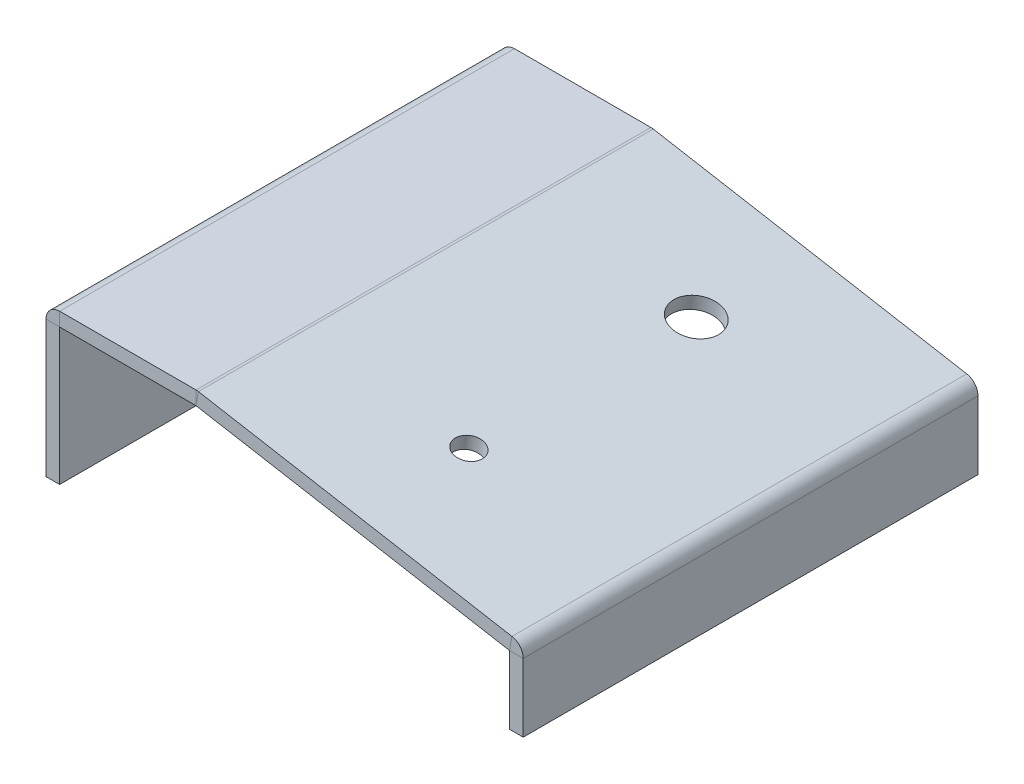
ISO-10303-21;
HEADER;
FILE_DESCRIPTION(('STEP AP214'),'2;1');
FILE_NAME('part.step','',(''),(''),'','','');
FILE_SCHEMA(('AUTOMOTIVE_DESIGN { 1 0 10303 214 1 1 1 1 }'));
ENDSEC;
DATA;
#1=APPLICATION_CONTEXT('core data for automotive mechanical design processes');
#2=APPLICATION_PROTOCOL_DEFINITION('international standard','automotive_design',2000,#1);
#3=PRODUCT_CONTEXT('',#1,'mechanical');
#4=PRODUCT('Part','Part','',(#3));
#5=PRODUCT_RELATED_PRODUCT_CATEGORY('part','',(#4));
#6=PRODUCT_DEFINITION_FORMATION('','',#4);
#7=PRODUCT_DEFINITION_CONTEXT('part definition',#1,'design');
#8=PRODUCT_DEFINITION('design','',#6,#7);
#9=PRODUCT_DEFINITION_SHAPE('','',#8);
#10=(LENGTH_UNIT() NAMED_UNIT(*) SI_UNIT(.MILLI.,.METRE.));
#11=(NAMED_UNIT(*) PLANE_ANGLE_UNIT() SI_UNIT($,.RADIAN.));
#12=(NAMED_UNIT(*) SI_UNIT($,.STERADIAN.) SOLID_ANGLE_UNIT());
#13=UNCERTAINTY_MEASURE_WITH_UNIT(LENGTH_MEASURE(1.E-05),#10,'distance_accuracy_value','');
#14=(GEOMETRIC_REPRESENTATION_CONTEXT(3) GLOBAL_UNCERTAINTY_ASSIGNED_CONTEXT((#13)) GLOBAL_UNIT_ASSIGNED_CONTEXT((#10,
#11,#12)) REPRESENTATION_CONTEXT('',''));
#15=CARTESIAN_POINT('',(0.,0.,0.));
#16=DIRECTION('',(0.,0.,1.));
#17=DIRECTION('',(1.,0.,0.));
#18=AXIS2_PLACEMENT_3D('',#15,#16,#17);
#19=CARTESIAN_POINT('',(0.91153142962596,10.418906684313,-100.));
#20=DIRECTION('',(-0.173648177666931,-0.984807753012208,0.));
#21=DIRECTION('',(0.,0.,-1.));
#22=AXIS2_PLACEMENT_3D('',#19,#20,#21);
#23=PLANE('',#22);
#24=CARTESIAN_POINT('',(94.4682679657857,-6.07767019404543,-25.));
#25=DIRECTION('',(0.173648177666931,0.984807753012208,0.));
#26=DIRECTION('',(0.,0.,1.));
#27=AXIS2_PLACEMENT_3D('',#24,#25,#26);
#28=CIRCLE('',#27,3.00000000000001);
#29=CARTESIAN_POINT('',(94.4682679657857,-6.07767019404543,-22.));
#30=VERTEX_POINT('',#29);
#31=EDGE_CURVE('E219',#30,#30,#28,.T.);
#32=ORIENTED_EDGE('',*,*,#31,.T.);
#33=EDGE_LOOP('',(#32));
#34=FACE_BOUND('',#33,.T.);
#35=CARTESIAN_POINT('',(94.4682679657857,-6.07767019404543,-75.));
#36=DIRECTION('',(0.173648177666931,0.984807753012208,0.));
#37=DIRECTION('',(0.,0.,1.));
#38=AXIS2_PLACEMENT_3D('',#35,#36,#37);
#39=CIRCLE('',#38,5.00000000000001);
#40=CARTESIAN_POINT('',(94.4682679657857,-6.07767019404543,-70.));
#41=VERTEX_POINT('',#40);
#42=EDGE_CURVE('E222',#41,#41,#39,.T.);
#43=ORIENTED_EDGE('',*,*,#42,.T.);
#44=EDGE_LOOP('',(#43));
#45=FACE_BOUND('',#44,.T.);
#46=DIRECTION('',(-0.984807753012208,0.173648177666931,0.));
#47=VECTOR('',#46,1.);
#48=CARTESIAN_POINT('',(0.91153142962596,10.418906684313,-100.));
#49=LINE('',#48,#47);
#50=CARTESIAN_POINT('',(128.936539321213,-12.155356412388,-100.));
#51=VERTEX_POINT('',#50);
#52=CARTESIAN_POINT('',(60.0001736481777,-1.51922469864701E-05,-100.));
#53=VERTEX_POINT('',#52);
#54=EDGE_CURVE('E73',#51,#53,#49,.T.);
#55=ORIENTED_EDGE('',*,*,#54,.F.);
#56=DIRECTION('',(0.,0.,1.));
#57=VECTOR('',#56,1.);
#58=CARTESIAN_POINT('',(128.936539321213,-12.155356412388,-100.));
#59=LINE('',#58,#57);
#60=CARTESIAN_POINT('',(128.936539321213,-12.155356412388,0.));
#61=VERTEX_POINT('',#60);
#62=EDGE_CURVE('E65',#51,#61,#59,.T.);
#63=ORIENTED_EDGE('',*,*,#62,.T.);
#64=DIRECTION('',(0.984807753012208,-0.173648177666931,0.));
#65=VECTOR('',#64,1.);
#66=CARTESIAN_POINT('',(0.91153142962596,10.418906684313,0.));
#67=LINE('',#66,#65);
#68=CARTESIAN_POINT('',(60.0001736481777,-1.51922469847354E-05,0.));
#69=VERTEX_POINT('',#68);
#70=EDGE_CURVE('E81',#69,#61,#67,.T.);
#71=ORIENTED_EDGE('',*,*,#70,.F.);
#72=DIRECTION('',(0.,0.,1.));
#73=VECTOR('',#72,1.);
#74=CARTESIAN_POINT('',(60.0001736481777,-1.51922469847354E-05,-100.));
#75=LINE('',#74,#73);
#76=EDGE_CURVE('E208',#53,#69,#75,.T.);
#77=ORIENTED_EDGE('',*,*,#76,.F.);
#78=EDGE_LOOP('',(#55,#63,#71,#77));
#79=FACE_BOUND('',#78,.T.);
#80=ADVANCED_FACE('F56',(#34,#45,#79),#23,.T.);
#81=CARTESIAN_POINT('',(0.,0.,-100.));
#82=DIRECTION('',(0.,-1.,0.));
#83=DIRECTION('',(0.,0.,-1.));
#84=AXIS2_PLACEMENT_3D('',#81,#82,#83);
#85=PLANE('',#84);
#86=DIRECTION('',(-1.,0.,0.));
#87=VECTOR('',#86,1.);
#88=CARTESIAN_POINT('',(0.,0.,-100.));
#89=LINE('',#88,#87);
#90=CARTESIAN_POINT('',(60.,0.,-100.));
#91=VERTEX_POINT('',#90);
#92=CARTESIAN_POINT('',(30.,0.,-100.));
#93=VERTEX_POINT('',#92);
#94=EDGE_CURVE('E266',#91,#93,#89,.T.);
#95=ORIENTED_EDGE('',*,*,#94,.F.);
#96=DIRECTION('',(0.,0.,1.));
#97=VECTOR('',#96,1.);
#98=CARTESIAN_POINT('',(60.,0.,-100.));
#99=LINE('',#98,#97);
#100=CARTESIAN_POINT('',(60.,0.,0.));
#101=VERTEX_POINT('',#100);
#102=EDGE_CURVE('E321',#91,#101,#99,.T.);
#103=ORIENTED_EDGE('',*,*,#102,.T.);
#104=DIRECTION('',(1.,0.,0.));
#105=VECTOR('',#104,1.);
#106=CARTESIAN_POINT('',(0.,0.,0.));
#107=LINE('',#106,#105);
#108=CARTESIAN_POINT('',(30.,0.,0.));
#109=VERTEX_POINT('',#108);
#110=EDGE_CURVE('E270',#109,#101,#107,.T.);
#111=ORIENTED_EDGE('',*,*,#110,.F.);
#112=DIRECTION('',(0.,0.,1.));
#113=VECTOR('',#112,1.);
#114=CARTESIAN_POINT('',(30.,0.,-100.));
#115=LINE('',#114,#113);
#116=EDGE_CURVE('E257',#93,#109,#115,.T.);
#117=ORIENTED_EDGE('',*,*,#116,.F.);
#118=EDGE_LOOP('',(#95,#103,#111,#117));
#119=FACE_BOUND('',#118,.T.);
#120=ADVANCED_FACE('F404',(#119),#85,.T.);
#121=CARTESIAN_POINT('',(29.9999000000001,-29.9998957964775,-100.));
#122=DIRECTION('',(1.,0.,0.));
#123=DIRECTION('',(0.,0.,-1.));
#124=AXIS2_PLACEMENT_3D('',#121,#122,#123);
#125=PLANE('',#124);
#126=CARTESIAN_POINT('',(29.9999000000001,-22.9998957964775,-50.));
#127=DIRECTION('',(-1.,0.,0.));
#128=DIRECTION('',(0.,0.,1.));
#129=AXIS2_PLACEMENT_3D('',#126,#127,#128);
#130=CIRCLE('',#129,2.25);
#131=CARTESIAN_POINT('',(29.9999000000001,-22.9998957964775,-47.75));
#132=VERTEX_POINT('',#131);
#133=EDGE_CURVE('E265',#132,#132,#130,.T.);
#134=ORIENTED_EDGE('',*,*,#133,.T.);
#135=EDGE_LOOP('',(#134));
#136=FACE_BOUND('',#135,.T.);
#137=DIRECTION('',(0.,-1.,0.));
#138=VECTOR('',#137,1.);
#139=CARTESIAN_POINT('',(29.9999000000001,-29.9998957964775,-100.));
#140=LINE('',#139,#138);
#141=CARTESIAN_POINT('',(29.9999,-9.99999999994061E-05,-100.));
#142=VERTEX_POINT('',#141);
#143=CARTESIAN_POINT('',(29.9999000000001,-29.9998957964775,-100.));
#144=VERTEX_POINT('',#143);
#145=EDGE_CURVE('E287',#142,#144,#140,.T.);
#146=ORIENTED_EDGE('',*,*,#145,.F.);
#147=DIRECTION('',(0.,0.,1.));
#148=VECTOR('',#147,1.);
#149=CARTESIAN_POINT('',(29.9999,-9.99999999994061E-05,-100.));
#150=LINE('',#149,#148);
#151=CARTESIAN_POINT('',(29.9999,-9.99999999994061E-05,0.));
#152=VERTEX_POINT('',#151);
#153=EDGE_CURVE('E304',#142,#152,#150,.T.);
#154=ORIENTED_EDGE('',*,*,#153,.T.);
#155=DIRECTION('',(0.,1.,0.));
#156=VECTOR('',#155,1.);
#157=CARTESIAN_POINT('',(29.9999000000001,-29.9998957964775,0.));
#158=LINE('',#157,#156);
#159=CARTESIAN_POINT('',(29.9999000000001,-29.9998957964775,0.));
#160=VERTEX_POINT('',#159);
#161=EDGE_CURVE('E290',#160,#152,#158,.T.);
#162=ORIENTED_EDGE('',*,*,#161,.F.);
#163=DIRECTION('',(0.,0.,1.));
#164=VECTOR('',#163,1.);
#165=CARTESIAN_POINT('',(29.9999000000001,-29.9998957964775,0.));
#166=LINE('',#165,#164);
#167=EDGE_CURVE('E280',#144,#160,#166,.T.);
#168=ORIENTED_EDGE('',*,*,#167,.F.);
#169=EDGE_LOOP('',(#146,#154,#162,#168));
#170=FACE_BOUND('',#169,.T.);
#171=ADVANCED_FACE('F432',(#136,#170),#125,.T.);
#172=CARTESIAN_POINT('',(26.9999000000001,-29.9998957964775,-100.));
#173=DIRECTION('',(1.,0.,0.));
#174=DIRECTION('',(0.,0.,-1.));
#175=AXIS2_PLACEMENT_3D('',#172,#173,#174);
#176=PLANE('',#175);
#177=DIRECTION('',(0.,0.,1.));
#178=VECTOR('',#177,1.);
#179=CARTESIAN_POINT('',(26.9999,-0.000100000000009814,-100.));
#180=LINE('',#179,#178);
#181=CARTESIAN_POINT('',(26.9999,-0.000100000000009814,-100.));
#182=VERTEX_POINT('',#181);
#183=CARTESIAN_POINT('',(26.9999,-0.000100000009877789,0.));
#184=VERTEX_POINT('',#183);
#185=EDGE_CURVE('E298',#182,#184,#180,.T.);
#186=ORIENTED_EDGE('',*,*,#185,.F.);
#187=DIRECTION('',(0.,-1.,0.));
#188=VECTOR('',#187,1.);
#189=CARTESIAN_POINT('',(26.9999000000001,-29.9998957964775,-100.));
#190=LINE('',#189,#188);
#191=CARTESIAN_POINT('',(26.9999000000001,-29.9998957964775,-100.));
#192=VERTEX_POINT('',#191);
#193=EDGE_CURVE('E295',#182,#192,#190,.T.);
#194=ORIENTED_EDGE('',*,*,#193,.T.);
#195=DIRECTION('',(0.,0.,1.));
#196=VECTOR('',#195,1.);
#197=CARTESIAN_POINT('',(26.9999000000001,-29.9998957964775,0.));
#198=LINE('',#197,#196);
#199=CARTESIAN_POINT('',(26.9999000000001,-29.9998957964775,0.));
#200=VERTEX_POINT('',#199);
#201=EDGE_CURVE('E283',#192,#200,#198,.T.);
#202=ORIENTED_EDGE('',*,*,#201,.T.);
#203=DIRECTION('',(0.,1.,0.));
#204=VECTOR('',#203,1.);
#205=CARTESIAN_POINT('',(26.9999000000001,-29.9998957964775,0.));
#206=LINE('',#205,#204);
#207=EDGE_CURVE('E286',#200,#184,#206,.T.);
#208=ORIENTED_EDGE('',*,*,#207,.T.);
#209=EDGE_LOOP('',(#186,#194,#202,#208));
#210=FACE_BOUND('',#209,.T.);
#211=CARTESIAN_POINT('',(26.9999000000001,-22.9998957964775,-50.));
#212=DIRECTION('',(-1.,0.,0.));
#213=DIRECTION('',(0.,0.,1.));
#214=AXIS2_PLACEMENT_3D('',#211,#212,#213);
#215=CIRCLE('',#214,2.25);
#216=CARTESIAN_POINT('',(26.9999000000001,-22.9998957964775,-47.75));
#217=VERTEX_POINT('',#216);
#218=EDGE_CURVE('E277',#217,#217,#215,.T.);
#219=ORIENTED_EDGE('',*,*,#218,.F.);
#220=EDGE_LOOP('',(#219));
#221=FACE_BOUND('',#220,.T.);
#222=ADVANCED_FACE('F417',(#210,#221),#176,.F.);
#223=CARTESIAN_POINT('',(26.9999000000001,-29.9998957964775,0.));
#224=DIRECTION('',(0.,1.,0.));
#225=DIRECTION('',(0.,0.,-1.));
#226=AXIS2_PLACEMENT_3D('',#223,#224,#225);
#227=PLANE('',#226);
#228=ORIENTED_EDGE('',*,*,#167,.T.);
#229=DIRECTION('',(1.,0.,0.));
#230=VECTOR('',#229,1.);
#231=CARTESIAN_POINT('',(26.9999000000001,-29.9998957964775,0.));
#232=LINE('',#231,#230);
#233=EDGE_CURVE('E294',#200,#160,#232,.T.);
#234=ORIENTED_EDGE('',*,*,#233,.F.);
#235=ORIENTED_EDGE('',*,*,#201,.F.);
#236=DIRECTION('',(1.,0.,0.));
#237=VECTOR('',#236,1.);
#238=CARTESIAN_POINT('',(26.9999000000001,-29.9998957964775,-100.));
#239=LINE('',#238,#237);
#240=EDGE_CURVE('E291',#192,#144,#239,.T.);
#241=ORIENTED_EDGE('',*,*,#240,.T.);
#242=EDGE_LOOP('',(#228,#234,#235,#241));
#243=FACE_BOUND('',#242,.T.);
#244=ADVANCED_FACE('F435',(#243),#227,.F.);
#245=CARTESIAN_POINT('',(26.9999000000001,-29.9998957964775,0.));
#246=DIRECTION('',(0.,0.,-1.));
#247=DIRECTION('',(0.,-1.,0.));
#248=AXIS2_PLACEMENT_3D('',#245,#246,#247);
#249=PLANE('',#248);
#250=DIRECTION('',(1.,0.,0.));
#251=VECTOR('',#250,1.);
#252=CARTESIAN_POINT('',(26.9999,-0.000100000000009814,0.));
#253=LINE('',#252,#251);
#254=EDGE_CURVE('E301',#184,#152,#253,.T.);
#255=ORIENTED_EDGE('',*,*,#254,.F.);
#256=ORIENTED_EDGE('',*,*,#207,.F.);
#257=ORIENTED_EDGE('',*,*,#233,.T.);
#258=ORIENTED_EDGE('',*,*,#161,.T.);
#259=EDGE_LOOP('',(#255,#256,#257,#258));
#260=FACE_BOUND('',#259,.T.);
#261=ADVANCED_FACE('F415',(#260),#249,.F.);
#262=CARTESIAN_POINT('',(26.9999000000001,-29.9998957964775,-100.));
#263=DIRECTION('',(0.,0.,1.));
#264=DIRECTION('',(0.,1.,0.));
#265=AXIS2_PLACEMENT_3D('',#262,#263,#264);
#266=PLANE('',#265);
#267=DIRECTION('',(-1.,0.,0.));
#268=VECTOR('',#267,1.);
#269=CARTESIAN_POINT('',(26.9999,-0.000100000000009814,-100.));
#270=LINE('',#269,#268);
#271=EDGE_CURVE('E307',#142,#182,#270,.T.);
#272=ORIENTED_EDGE('',*,*,#271,.F.);
#273=ORIENTED_EDGE('',*,*,#145,.T.);
#274=ORIENTED_EDGE('',*,*,#240,.F.);
#275=ORIENTED_EDGE('',*,*,#193,.F.);
#276=EDGE_LOOP('',(#272,#273,#274,#275));
#277=FACE_BOUND('',#276,.T.);
#278=ADVANCED_FACE('F429',(#277),#266,.F.);
#279=CARTESIAN_POINT('',(26.9999000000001,-22.9998957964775,-50.));
#280=DIRECTION('',(1.,0.,0.));
#281=DIRECTION('',(0.,0.,-1.));
#282=AXIS2_PLACEMENT_3D('',#279,#280,#281);
#283=CYLINDRICAL_SURFACE('',#282,2.25);
#284=ORIENTED_EDGE('',*,*,#218,.T.);
#285=EDGE_LOOP('',(#284));
#286=FACE_BOUND('',#285,.T.);
#287=ORIENTED_EDGE('',*,*,#133,.F.);
#288=EDGE_LOOP('',(#287));
#289=FACE_BOUND('',#288,.T.);
#290=ADVANCED_FACE('F464',(#286,#289),#283,.F.);
#291=CARTESIAN_POINT('',(0.,3.,-100.));
#292=DIRECTION('',(0.,-1.,0.));
#293=DIRECTION('',(0.,0.,-1.));
#294=AXIS2_PLACEMENT_3D('',#291,#292,#293);
#295=PLANE('',#294);
#296=DIRECTION('',(0.,0.,1.));
#297=VECTOR('',#296,1.);
#298=CARTESIAN_POINT('',(60.,3.,-100.));
#299=LINE('',#298,#297);
#300=CARTESIAN_POINT('',(60.,3.,-100.));
#301=VERTEX_POINT('',#300);
#302=CARTESIAN_POINT('',(60.,3.,0.));
#303=VERTEX_POINT('',#302);
#304=EDGE_CURVE('E310',#301,#303,#299,.T.);
#305=ORIENTED_EDGE('',*,*,#304,.F.);
#306=DIRECTION('',(-1.,0.,0.));
#307=VECTOR('',#306,1.);
#308=CARTESIAN_POINT('',(0.,3.,-100.));
#309=LINE('',#308,#307);
#310=CARTESIAN_POINT('',(30.,3.,-100.));
#311=VERTEX_POINT('',#310);
#312=EDGE_CURVE('E275',#301,#311,#309,.T.);
#313=ORIENTED_EDGE('',*,*,#312,.T.);
#314=DIRECTION('',(0.,0.,1.));
#315=VECTOR('',#314,1.);
#316=CARTESIAN_POINT('',(30.,3.,-100.));
#317=LINE('',#316,#315);
#318=CARTESIAN_POINT('',(30.,3.,0.));
#319=VERTEX_POINT('',#318);
#320=EDGE_CURVE('E272',#311,#319,#317,.T.);
#321=ORIENTED_EDGE('',*,*,#320,.T.);
#322=DIRECTION('',(1.,0.,0.));
#323=VECTOR('',#322,1.);
#324=CARTESIAN_POINT('',(0.,3.,0.));
#325=LINE('',#324,#323);
#326=EDGE_CURVE('E271',#319,#303,#325,.T.);
#327=ORIENTED_EDGE('',*,*,#326,.T.);
#328=EDGE_LOOP('',(#305,#313,#321,#327));
#329=FACE_BOUND('',#328,.T.);
#330=ADVANCED_FACE('F395',(#329),#295,.F.);
#331=CARTESIAN_POINT('',(0.,3.,0.));
#332=DIRECTION('',(0.,0.,-1.));
#333=DIRECTION('',(-1.,0.,0.));
#334=AXIS2_PLACEMENT_3D('',#331,#332,#333);
#335=PLANE('',#334);
#336=DIRECTION('',(0.,-1.,0.));
#337=VECTOR('',#336,1.);
#338=CARTESIAN_POINT('',(60.,3.,0.));
#339=LINE('',#338,#337);
#340=EDGE_CURVE('E318',#303,#101,#339,.T.);
#341=ORIENTED_EDGE('',*,*,#340,.F.);
#342=ORIENTED_EDGE('',*,*,#326,.F.);
#343=DIRECTION('',(0.,-1.,0.));
#344=VECTOR('',#343,1.);
#345=CARTESIAN_POINT('',(30.,3.,0.));
#346=LINE('',#345,#344);
#347=EDGE_CURVE('E267',#319,#109,#346,.T.);
#348=ORIENTED_EDGE('',*,*,#347,.T.);
#349=ORIENTED_EDGE('',*,*,#110,.T.);
#350=EDGE_LOOP('',(#341,#342,#348,#349));
#351=FACE_BOUND('',#350,.T.);
#352=ADVANCED_FACE('F388',(#351),#335,.F.);
#353=CARTESIAN_POINT('',(0.,3.,-100.));
#354=DIRECTION('',(0.,0.,1.));
#355=DIRECTION('',(1.,0.,0.));
#356=AXIS2_PLACEMENT_3D('',#353,#354,#355);
#357=PLANE('',#356);
#358=DIRECTION('',(0.,1.,0.));
#359=VECTOR('',#358,1.);
#360=CARTESIAN_POINT('',(60.,3.,-100.));
#361=LINE('',#360,#359);
#362=EDGE_CURVE('E324',#91,#301,#361,.T.);
#363=ORIENTED_EDGE('',*,*,#362,.F.);
#364=ORIENTED_EDGE('',*,*,#94,.T.);
#365=DIRECTION('',(0.,1.,0.));
#366=VECTOR('',#365,1.);
#367=CARTESIAN_POINT('',(30.,3.,-100.));
#368=LINE('',#367,#366);
#369=EDGE_CURVE('E262',#93,#311,#368,.T.);
#370=ORIENTED_EDGE('',*,*,#369,.T.);
#371=ORIENTED_EDGE('',*,*,#312,.F.);
#372=EDGE_LOOP('',(#363,#364,#370,#371));
#373=FACE_BOUND('',#372,.T.);
#374=ADVANCED_FACE('F401',(#373),#357,.F.);
#375=CARTESIAN_POINT('',(30.,-9.99999999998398E-05,-100.));
#376=DIRECTION('',(0.,0.,-1.));
#377=DIRECTION('',(-1.,0.,0.));
#378=AXIS2_PLACEMENT_3D('',#375,#376,#377);
#379=PLANE('',#378);
#380=ORIENTED_EDGE('',*,*,#369,.F.);
#381=CARTESIAN_POINT('',(30.,-9.99999999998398E-05,-100.));
#382=DIRECTION('',(0.,0.,1.));
#383=DIRECTION('',(1.,0.,0.));
#384=AXIS2_PLACEMENT_3D('',#381,#382,#383);
#385=CIRCLE('',#384,9.99999999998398E-05);
#386=EDGE_CURVE('E245',#93,#142,#385,.T.);
#387=ORIENTED_EDGE('',*,*,#386,.T.);
#388=ORIENTED_EDGE('',*,*,#271,.T.);
#389=CARTESIAN_POINT('',(30.,-9.99999999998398E-05,-100.));
#390=DIRECTION('',(0.,0.,1.));
#391=DIRECTION('',(1.,0.,0.));
#392=AXIS2_PLACEMENT_3D('',#389,#390,#391);
#393=CIRCLE('',#392,3.0001);
#394=EDGE_CURVE('E250',#311,#182,#393,.T.);
#395=ORIENTED_EDGE('',*,*,#394,.F.);
#396=EDGE_LOOP('',(#380,#387,#388,#395));
#397=FACE_BOUND('',#396,.T.);
#398=ADVANCED_FACE('F426',(#397),#379,.T.);
#399=CARTESIAN_POINT('',(30.,-9.99999999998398E-05,0.));
#400=DIRECTION('',(0.,0.,1.));
#401=DIRECTION('',(1.,0.,0.));
#402=AXIS2_PLACEMENT_3D('',#399,#400,#401);
#403=PLANE('',#402);
#404=ORIENTED_EDGE('',*,*,#254,.T.);
#405=CARTESIAN_POINT('',(30.,-9.99999999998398E-05,0.));
#406=DIRECTION('',(0.,0.,1.));
#407=DIRECTION('',(1.,0.,0.));
#408=AXIS2_PLACEMENT_3D('',#405,#406,#407);
#409=CIRCLE('',#408,9.99999999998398E-05);
#410=EDGE_CURVE('E254',#152,#109,#409,.F.);
#411=ORIENTED_EDGE('',*,*,#410,.T.);
#412=ORIENTED_EDGE('',*,*,#347,.F.);
#413=CARTESIAN_POINT('',(30.,-9.99999999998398E-05,0.));
#414=DIRECTION('',(0.,0.,-1.));
#415=DIRECTION('',(-1.,0.,0.));
#416=AXIS2_PLACEMENT_3D('',#413,#414,#415);
#417=CIRCLE('',#416,3.0001);
#418=EDGE_CURVE('E253',#184,#319,#417,.T.);
#419=ORIENTED_EDGE('',*,*,#418,.F.);
#420=EDGE_LOOP('',(#404,#411,#412,#419));
#421=FACE_BOUND('',#420,.T.);
#422=ADVANCED_FACE('F412',(#421),#403,.T.);
#423=CARTESIAN_POINT('',(30.,-9.99999999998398E-05,-150.044989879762));
#424=DIRECTION('',(0.,0.,1.));
#425=DIRECTION('',(1.,0.,0.));
#426=AXIS2_PLACEMENT_3D('',#423,#424,#425);
#427=CYLINDRICAL_SURFACE('',#426,3.0001);
#428=ORIENTED_EDGE('',*,*,#418,.T.);
#429=ORIENTED_EDGE('',*,*,#320,.F.);
#430=ORIENTED_EDGE('',*,*,#394,.T.);
#431=ORIENTED_EDGE('',*,*,#185,.T.);
#432=EDGE_LOOP('',(#428,#429,#430,#431));
#433=FACE_BOUND('',#432,.T.);
#434=ADVANCED_FACE('F423',(#433),#427,.T.);
#435=CARTESIAN_POINT('',(30.,-9.99999999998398E-05,-150.044989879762));
#436=DIRECTION('',(0.,0.,1.));
#437=DIRECTION('',(1.,0.,0.));
#438=AXIS2_PLACEMENT_3D('',#435,#436,#437);
#439=CYLINDRICAL_SURFACE('',#438,9.99999999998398E-05);
#440=ORIENTED_EDGE('',*,*,#410,.F.);
#441=ORIENTED_EDGE('',*,*,#153,.F.);
#442=ORIENTED_EDGE('',*,*,#386,.F.);
#443=ORIENTED_EDGE('',*,*,#116,.T.);
#444=EDGE_LOOP('',(#440,#441,#442,#443));
#445=FACE_BOUND('',#444,.T.);
#446=ADVANCED_FACE('F409',(#445),#439,.F.);
#447=CARTESIAN_POINT('',(60.,-0.00100000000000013,-100.));
#448=DIRECTION('',(0.,0.,-1.));
#449=DIRECTION('',(-1.,0.,0.));
#450=AXIS2_PLACEMENT_3D('',#447,#448,#449);
#451=PLANE('',#450);
#452=DIRECTION('',(0.173648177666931,0.984807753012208,0.));
#453=VECTOR('',#452,1.);
#454=CARTESIAN_POINT('',(60.5211181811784,2.95440806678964,-100.));
#455=LINE('',#454,#453);
#456=CARTESIAN_POINT('',(60.5211181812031,2.95440806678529,-100.));
#457=VERTEX_POINT('',#456);
#458=EDGE_CURVE('E215',#53,#457,#455,.T.);
#459=ORIENTED_EDGE('',*,*,#458,.F.);
#460=CARTESIAN_POINT('',(60.,-0.00100000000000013,-100.));
#461=DIRECTION('',(0.,0.,-1.));
#462=DIRECTION('',(-1.,0.,0.));
#463=AXIS2_PLACEMENT_3D('',#460,#461,#462);
#464=CIRCLE('',#463,0.00100000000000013);
#465=EDGE_CURVE('E218',#53,#91,#464,.F.);
#466=ORIENTED_EDGE('',*,*,#465,.T.);
#467=ORIENTED_EDGE('',*,*,#362,.T.);
#468=CARTESIAN_POINT('',(60.,-0.00100000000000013,-100.));
#469=DIRECTION('',(0.,0.,1.));
#470=DIRECTION('',(1.,0.,0.));
#471=AXIS2_PLACEMENT_3D('',#468,#469,#470);
#472=CIRCLE('',#471,3.001);
#473=EDGE_CURVE('E238',#457,#301,#472,.T.);
#474=ORIENTED_EDGE('',*,*,#473,.F.);
#475=EDGE_LOOP('',(#459,#466,#467,#474));
#476=FACE_BOUND('',#475,.T.);
#477=ADVANCED_FACE('F399',(#476),#451,.T.);
#478=CARTESIAN_POINT('',(60.,-0.00100000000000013,0.));
#479=DIRECTION('',(0.,0.,1.));
#480=DIRECTION('',(1.,0.,0.));
#481=AXIS2_PLACEMENT_3D('',#478,#479,#480);
#482=PLANE('',#481);
#483=CARTESIAN_POINT('',(60.,-0.00100000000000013,0.));
#484=DIRECTION('',(0.,0.,-1.));
#485=DIRECTION('',(-1.,0.,0.));
#486=AXIS2_PLACEMENT_3D('',#483,#484,#485);
#487=CIRCLE('',#486,0.00100000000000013);
#488=EDGE_CURVE('E242',#101,#69,#487,.T.);
#489=ORIENTED_EDGE('',*,*,#488,.T.);
#490=DIRECTION('',(-0.173648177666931,-0.984807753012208,0.));
#491=VECTOR('',#490,1.);
#492=CARTESIAN_POINT('',(60.5211181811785,2.95440806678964,0.));
#493=LINE('',#492,#491);
#494=CARTESIAN_POINT('',(60.5211181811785,2.95440806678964,0.));
#495=VERTEX_POINT('',#494);
#496=EDGE_CURVE('E225',#495,#69,#493,.T.);
#497=ORIENTED_EDGE('',*,*,#496,.F.);
#498=CARTESIAN_POINT('',(60.,-0.00100000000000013,0.));
#499=DIRECTION('',(0.,0.,-1.));
#500=DIRECTION('',(-1.,0.,0.));
#501=AXIS2_PLACEMENT_3D('',#498,#499,#500);
#502=CIRCLE('',#501,3.001);
#503=EDGE_CURVE('E241',#303,#495,#502,.T.);
#504=ORIENTED_EDGE('',*,*,#503,.F.);
#505=ORIENTED_EDGE('',*,*,#340,.T.);
#506=EDGE_LOOP('',(#489,#497,#504,#505));
#507=FACE_BOUND('',#506,.T.);
#508=ADVANCED_FACE('F384',(#507),#482,.T.);
#509=CARTESIAN_POINT('',(60.,-0.00100000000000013,50.0449898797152));
#510=DIRECTION('',(0.,0.,-1.));
#511=DIRECTION('',(-1.,0.,0.));
#512=AXIS2_PLACEMENT_3D('',#509,#510,#511);
#513=CYLINDRICAL_SURFACE('',#512,3.001);
#514=ORIENTED_EDGE('',*,*,#304,.T.);
#515=ORIENTED_EDGE('',*,*,#503,.T.);
#516=DIRECTION('',(0.,0.,1.));
#517=VECTOR('',#516,1.);
#518=CARTESIAN_POINT('',(60.5211181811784,2.95440806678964,-100.));
#519=LINE('',#518,#517);
#520=EDGE_CURVE('E228',#457,#495,#519,.T.);
#521=ORIENTED_EDGE('',*,*,#520,.F.);
#522=ORIENTED_EDGE('',*,*,#473,.T.);
#523=EDGE_LOOP('',(#514,#515,#521,#522));
#524=FACE_BOUND('',#523,.T.);
#525=ADVANCED_FACE('F392',(#524),#513,.T.);
#526=CARTESIAN_POINT('',(60.,-0.00100000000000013,50.0449898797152));
#527=DIRECTION('',(0.,0.,-1.));
#528=DIRECTION('',(-1.,0.,0.));
#529=AXIS2_PLACEMENT_3D('',#526,#527,#528);
#530=CYLINDRICAL_SURFACE('',#529,0.00100000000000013);
#531=ORIENTED_EDGE('',*,*,#102,.F.);
#532=ORIENTED_EDGE('',*,*,#465,.F.);
#533=ORIENTED_EDGE('',*,*,#76,.T.);
#534=ORIENTED_EDGE('',*,*,#488,.F.);
#535=EDGE_LOOP('',(#531,#532,#533,#534));
#536=FACE_BOUND('',#535,.T.);
#537=ADVANCED_FACE('F383',(#536),#530,.F.);
#538=CARTESIAN_POINT('',(94.9892124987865,-3.1232469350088,-75.));
#539=DIRECTION('',(-0.173648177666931,-0.984807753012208,0.));
#540=DIRECTION('',(0.,0.,-1.));
#541=AXIS2_PLACEMENT_3D('',#538,#539,#540);
#542=CYLINDRICAL_SURFACE('',#541,5.00000000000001);
#543=CARTESIAN_POINT('',(94.9892124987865,-3.1232469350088,-75.));
#544=DIRECTION('',(0.173648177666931,0.984807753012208,0.));
#545=DIRECTION('',(0.,0.,1.));
#546=AXIS2_PLACEMENT_3D('',#543,#544,#545);
#547=CIRCLE('',#546,5.00000000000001);
#548=CARTESIAN_POINT('',(94.9892124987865,-3.1232469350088,-70.));
#549=VERTEX_POINT('',#548);
#550=EDGE_CURVE('E233',#549,#549,#547,.T.);
#551=ORIENTED_EDGE('',*,*,#550,.T.);
#552=EDGE_LOOP('',(#551));
#553=FACE_BOUND('',#552,.T.);
#554=ORIENTED_EDGE('',*,*,#42,.F.);
#555=EDGE_LOOP('',(#554));
#556=FACE_BOUND('',#555,.T.);
#557=ADVANCED_FACE('F492',(#553,#556),#542,.F.);
#558=CARTESIAN_POINT('',(94.9892124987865,-3.1232469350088,-25.));
#559=DIRECTION('',(-0.173648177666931,-0.984807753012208,0.));
#560=DIRECTION('',(0.,0.,-1.));
#561=AXIS2_PLACEMENT_3D('',#558,#559,#560);
#562=CYLINDRICAL_SURFACE('',#561,3.00000000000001);
#563=CARTESIAN_POINT('',(94.9892124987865,-3.1232469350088,-25.));
#564=DIRECTION('',(0.173648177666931,0.984807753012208,0.));
#565=DIRECTION('',(0.,0.,1.));
#566=AXIS2_PLACEMENT_3D('',#563,#564,#565);
#567=CIRCLE('',#566,3.00000000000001);
#568=CARTESIAN_POINT('',(94.9892124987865,-3.1232469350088,-22.));
#569=VERTEX_POINT('',#568);
#570=EDGE_CURVE('E230',#569,#569,#567,.T.);
#571=ORIENTED_EDGE('',*,*,#570,.T.);
#572=EDGE_LOOP('',(#571));
#573=FACE_BOUND('',#572,.T.);
#574=ORIENTED_EDGE('',*,*,#31,.F.);
#575=EDGE_LOOP('',(#574));
#576=FACE_BOUND('',#575,.T.);
#577=ADVANCED_FACE('F457',(#573,#576),#562,.F.);
#578=CARTESIAN_POINT('',(1.43247596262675,13.3733299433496,-100.));
#579=DIRECTION('',(-0.173648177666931,-0.984807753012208,0.));
#580=DIRECTION('',(0.,0.,-1.));
#581=AXIS2_PLACEMENT_3D('',#578,#579,#580);
#582=PLANE('',#581);
#583=DIRECTION('',(0.,0.,1.));
#584=VECTOR('',#583,1.);
#585=CARTESIAN_POINT('',(129.457483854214,-9.20093315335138,-100.));
#586=LINE('',#585,#584);
#587=CARTESIAN_POINT('',(129.457483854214,-9.20093315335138,-99.9999999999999));
#588=VERTEX_POINT('',#587);
#589=CARTESIAN_POINT('',(129.457483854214,-9.20093315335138,0.));
#590=VERTEX_POINT('',#589);
#591=EDGE_CURVE('E327',#588,#590,#586,.T.);
#592=ORIENTED_EDGE('',*,*,#591,.F.);
#593=DIRECTION('',(-0.984807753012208,0.173648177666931,0.));
#594=VECTOR('',#593,1.);
#595=CARTESIAN_POINT('',(1.43247596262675,13.3733299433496,-100.));
#596=LINE('',#595,#594);
#597=EDGE_CURVE('E60',#588,#457,#596,.T.);
#598=ORIENTED_EDGE('',*,*,#597,.T.);
#599=ORIENTED_EDGE('',*,*,#520,.T.);
#600=DIRECTION('',(0.984807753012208,-0.173648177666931,0.));
#601=VECTOR('',#600,1.);
#602=CARTESIAN_POINT('',(1.43247596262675,13.3733299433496,0.));
#603=LINE('',#602,#601);
#604=EDGE_CURVE('E227',#495,#590,#603,.T.);
#605=ORIENTED_EDGE('',*,*,#604,.T.);
#606=EDGE_LOOP('',(#592,#598,#599,#605));
#607=FACE_BOUND('',#606,.T.);
#608=ORIENTED_EDGE('',*,*,#570,.F.);
#609=EDGE_LOOP('',(#608));
#610=FACE_BOUND('',#609,.T.);
#611=ORIENTED_EDGE('',*,*,#550,.F.);
#612=EDGE_LOOP('',(#611));
#613=FACE_BOUND('',#612,.T.);
#614=ADVANCED_FACE('F342',(#607,#610,#613),#582,.F.);
#615=CARTESIAN_POINT('',(1.43247596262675,13.3733299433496,0.));
#616=DIRECTION('',(0.,0.,-1.));
#617=DIRECTION('',(-0.984807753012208,0.173648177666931,0.));
#618=AXIS2_PLACEMENT_3D('',#615,#616,#617);
#619=PLANE('',#618);
#620=DIRECTION('',(-0.173648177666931,-0.984807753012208,0.));
#621=VECTOR('',#620,1.);
#622=CARTESIAN_POINT('',(129.457483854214,-9.20093315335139,0.));
#623=LINE('',#622,#621);
#624=EDGE_CURVE('E334',#590,#61,#623,.T.);
#625=ORIENTED_EDGE('',*,*,#624,.F.);
#626=ORIENTED_EDGE('',*,*,#604,.F.);
#627=ORIENTED_EDGE('',*,*,#496,.T.);
#628=ORIENTED_EDGE('',*,*,#70,.T.);
#629=EDGE_LOOP('',(#625,#626,#627,#628));
#630=FACE_BOUND('',#629,.T.);
#631=ADVANCED_FACE('F346',(#630),#619,.F.);
#632=CARTESIAN_POINT('',(1.43247596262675,13.3733299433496,-100.));
#633=DIRECTION('',(0.,0.,1.));
#634=DIRECTION('',(0.984807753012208,-0.173648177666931,0.));
#635=AXIS2_PLACEMENT_3D('',#632,#633,#634);
#636=PLANE('',#635);
#637=DIRECTION('',(0.173648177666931,0.984807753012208,0.));
#638=VECTOR('',#637,1.);
#639=CARTESIAN_POINT('',(129.457483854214,-9.20093315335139,-100.));
#640=LINE('',#639,#638);
#641=EDGE_CURVE('E14',#51,#588,#640,.T.);
#642=ORIENTED_EDGE('',*,*,#641,.F.);
#643=ORIENTED_EDGE('',*,*,#54,.T.);
#644=ORIENTED_EDGE('',*,*,#458,.T.);
#645=ORIENTED_EDGE('',*,*,#597,.F.);
#646=EDGE_LOOP('',(#642,#643,#644,#645));
#647=FACE_BOUND('',#646,.T.);
#648=ADVANCED_FACE('F58',(#647),#636,.F.);
#649=CARTESIAN_POINT('',(128.936521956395,-12.1554548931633,-99.9999999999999));
#650=DIRECTION('',(0.,0.,-1.));
#651=DIRECTION('',(-1.,0.,0.));
#652=AXIS2_PLACEMENT_3D('',#649,#650,#651);
#653=PLANE('',#652);
#654=DIRECTION('',(1.,0.,0.));
#655=VECTOR('',#654,1.);
#656=CARTESIAN_POINT('',(131.936621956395,-12.1554548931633,-100.));
#657=LINE('',#656,#655);
#658=CARTESIAN_POINT('',(128.936621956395,-12.1554548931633,-100.));
#659=VERTEX_POINT('',#658);
#660=CARTESIAN_POINT('',(131.936621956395,-12.1554548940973,-99.9999999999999));
#661=VERTEX_POINT('',#660);
#662=EDGE_CURVE('E370',#659,#661,#657,.T.);
#663=ORIENTED_EDGE('',*,*,#662,.F.);
#664=CARTESIAN_POINT('',(128.936521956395,-12.1554548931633,-99.9999999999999));
#665=DIRECTION('',(0.,0.,-1.));
#666=DIRECTION('',(-1.,0.,0.));
#667=AXIS2_PLACEMENT_3D('',#664,#665,#666);
#668=CIRCLE('',#667,9.99999999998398E-05);
#669=EDGE_CURVE('E209',#659,#51,#668,.F.);
#670=ORIENTED_EDGE('',*,*,#669,.T.);
#671=ORIENTED_EDGE('',*,*,#641,.T.);
#672=CARTESIAN_POINT('',(128.936521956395,-12.1554548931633,-99.9999999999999));
#673=DIRECTION('',(0.,0.,1.));
#674=DIRECTION('',(1.,0.,0.));
#675=AXIS2_PLACEMENT_3D('',#672,#673,#674);
#676=CIRCLE('',#675,3.0001);
#677=EDGE_CURVE('E201',#661,#588,#676,.T.);
#678=ORIENTED_EDGE('',*,*,#677,.F.);
#679=EDGE_LOOP('',(#663,#670,#671,#678));
#680=FACE_BOUND('',#679,.T.);
#681=ADVANCED_FACE('F369',(#680),#653,.T.);
#682=CARTESIAN_POINT('',(128.936521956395,-12.1554548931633,0.));
#683=DIRECTION('',(0.,0.,1.));
#684=DIRECTION('',(1.,0.,0.));
#685=AXIS2_PLACEMENT_3D('',#682,#683,#684);
#686=PLANE('',#685);
#687=CARTESIAN_POINT('',(128.936521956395,-12.1554548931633,0.));
#688=DIRECTION('',(0.,0.,-1.));
#689=DIRECTION('',(-1.,0.,0.));
#690=AXIS2_PLACEMENT_3D('',#687,#688,#689);
#691=CIRCLE('',#690,9.99999999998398E-05);
#692=CARTESIAN_POINT('',(128.936621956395,-12.1554548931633,0.));
#693=VERTEX_POINT('',#692);
#694=EDGE_CURVE('E205',#61,#693,#691,.T.);
#695=ORIENTED_EDGE('',*,*,#694,.T.);
#696=DIRECTION('',(-1.,0.,0.));
#697=VECTOR('',#696,1.);
#698=CARTESIAN_POINT('',(131.936621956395,-12.1554548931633,0.));
#699=LINE('',#698,#697);
#700=CARTESIAN_POINT('',(131.936621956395,-12.1554548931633,0.));
#701=VERTEX_POINT('',#700);
#702=EDGE_CURVE('E179',#701,#693,#699,.T.);
#703=ORIENTED_EDGE('',*,*,#702,.F.);
#704=CARTESIAN_POINT('',(128.936521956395,-12.1554548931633,0.));
#705=DIRECTION('',(0.,0.,-1.));
#706=DIRECTION('',(-1.,0.,0.));
#707=AXIS2_PLACEMENT_3D('',#704,#705,#706);
#708=CIRCLE('',#707,3.00010000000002);
#709=EDGE_CURVE('E204',#590,#701,#708,.T.);
#710=ORIENTED_EDGE('',*,*,#709,.F.);
#711=ORIENTED_EDGE('',*,*,#624,.T.);
#712=EDGE_LOOP('',(#695,#703,#710,#711));
#713=FACE_BOUND('',#712,.T.);
#714=ADVANCED_FACE('F354',(#713),#686,.T.);
#715=CARTESIAN_POINT('',(128.936521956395,-12.1554548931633,50.0449917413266));
#716=DIRECTION('',(0.,0.,-1.));
#717=DIRECTION('',(-1.,0.,0.));
#718=AXIS2_PLACEMENT_3D('',#715,#716,#717);
#719=CYLINDRICAL_SURFACE('',#718,3.0001);
#720=ORIENTED_EDGE('',*,*,#591,.T.);
#721=ORIENTED_EDGE('',*,*,#709,.T.);
#722=DIRECTION('',(0.,0.,1.));
#723=VECTOR('',#722,1.);
#724=CARTESIAN_POINT('',(131.936621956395,-12.1554548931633,-100.));
#725=LINE('',#724,#723);
#726=EDGE_CURVE('E361',#661,#701,#725,.T.);
#727=ORIENTED_EDGE('',*,*,#726,.F.);
#728=ORIENTED_EDGE('',*,*,#677,.T.);
#729=EDGE_LOOP('',(#720,#721,#727,#728));
#730=FACE_BOUND('',#729,.T.);
#731=ADVANCED_FACE('F351',(#730),#719,.T.);
#732=CARTESIAN_POINT('',(128.936521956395,-12.1554548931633,50.0449917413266));
#733=DIRECTION('',(0.,0.,-1.));
#734=DIRECTION('',(-1.,0.,0.));
#735=AXIS2_PLACEMENT_3D('',#732,#733,#734);
#736=CYLINDRICAL_SURFACE('',#735,9.99999999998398E-05);
#737=ORIENTED_EDGE('',*,*,#62,.F.);
#738=ORIENTED_EDGE('',*,*,#669,.F.);
#739=DIRECTION('',(0.,0.,1.));
#740=VECTOR('',#739,1.);
#741=CARTESIAN_POINT('',(128.936621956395,-12.1554548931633,-100.));
#742=LINE('',#741,#740);
#743=EDGE_CURVE('E196',#659,#693,#742,.T.);
#744=ORIENTED_EDGE('',*,*,#743,.T.);
#745=ORIENTED_EDGE('',*,*,#694,.F.);
#746=EDGE_LOOP('',(#737,#738,#744,#745));
#747=FACE_BOUND('',#746,.T.);
#748=ADVANCED_FACE('F375',(#747),#736,.F.);
#749=CARTESIAN_POINT('',(131.936621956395,-27.155273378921,0.));
#750=DIRECTION('',(0.,1.,0.));
#751=DIRECTION('',(0.,0.,1.));
#752=AXIS2_PLACEMENT_3D('',#749,#750,#751);
#753=PLANE('',#752);
#754=DIRECTION('',(0.,0.,-1.));
#755=VECTOR('',#754,1.);
#756=CARTESIAN_POINT('',(128.936621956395,-27.155273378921,0.));
#757=LINE('',#756,#755);
#758=CARTESIAN_POINT('',(128.936621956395,-27.155273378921,0.));
#759=VERTEX_POINT('',#758);
#760=CARTESIAN_POINT('',(128.936621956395,-27.155273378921,-100.));
#761=VERTEX_POINT('',#760);
#762=EDGE_CURVE('E189',#759,#761,#757,.T.);
#763=ORIENTED_EDGE('',*,*,#762,.T.);
#764=DIRECTION('',(-1.,0.,0.));
#765=VECTOR('',#764,1.);
#766=CARTESIAN_POINT('',(131.936621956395,-27.1552733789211,-100.));
#767=LINE('',#766,#765);
#768=CARTESIAN_POINT('',(131.936621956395,-27.1552733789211,-100.));
#769=VERTEX_POINT('',#768);
#770=EDGE_CURVE('E212',#769,#761,#767,.T.);
#771=ORIENTED_EDGE('',*,*,#770,.F.);
#772=DIRECTION('',(0.,0.,-1.));
#773=VECTOR('',#772,1.);
#774=CARTESIAN_POINT('',(131.936621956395,-27.155273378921,0.));
#775=LINE('',#774,#773);
#776=CARTESIAN_POINT('',(131.936621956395,-27.155273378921,0.));
#777=VERTEX_POINT('',#776);
#778=EDGE_CURVE('E191',#777,#769,#775,.T.);
#779=ORIENTED_EDGE('',*,*,#778,.F.);
#780=DIRECTION('',(-1.,0.,0.));
#781=VECTOR('',#780,1.);
#782=CARTESIAN_POINT('',(131.936621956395,-27.155273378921,0.));
#783=LINE('',#782,#781);
#784=EDGE_CURVE('E176',#777,#759,#783,.T.);
#785=ORIENTED_EDGE('',*,*,#784,.T.);
#786=EDGE_LOOP('',(#763,#771,#779,#785));
#787=FACE_BOUND('',#786,.T.);
#788=ADVANCED_FACE('F187',(#787),#753,.F.);
#789=CARTESIAN_POINT('',(131.936621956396,117.844726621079,-100.));
#790=DIRECTION('',(-1.,0.,0.));
#791=DIRECTION('',(0.,0.,-1.));
#792=AXIS2_PLACEMENT_3D('',#789,#790,#791);
#793=PLANE('',#792);
#794=DIRECTION('',(0.,1.,0.));
#795=VECTOR('',#794,1.);
#796=CARTESIAN_POINT('',(131.936621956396,117.844726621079,-100.));
#797=LINE('',#796,#795);
#798=EDGE_CURVE('E192',#769,#661,#797,.T.);
#799=ORIENTED_EDGE('',*,*,#798,.T.);
#800=ORIENTED_EDGE('',*,*,#726,.T.);
#801=DIRECTION('',(0.,-1.,0.));
#802=VECTOR('',#801,1.);
#803=CARTESIAN_POINT('',(131.936621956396,117.844726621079,0.));
#804=LINE('',#803,#802);
#805=EDGE_CURVE('E356',#701,#777,#804,.T.);
#806=ORIENTED_EDGE('',*,*,#805,.T.);
#807=ORIENTED_EDGE('',*,*,#778,.T.);
#808=EDGE_LOOP('',(#799,#800,#806,#807));
#809=FACE_BOUND('',#808,.T.);
#810=ADVANCED_FACE('F365',(#809),#793,.F.);
#811=CARTESIAN_POINT('',(131.936621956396,117.844726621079,0.));
#812=DIRECTION('',(0.,0.,-1.));
#813=DIRECTION('',(0.,1.,0.));
#814=AXIS2_PLACEMENT_3D('',#811,#812,#813);
#815=PLANE('',#814);
#816=ORIENTED_EDGE('',*,*,#805,.F.);
#817=ORIENTED_EDGE('',*,*,#702,.T.);
#818=DIRECTION('',(0.,-1.,0.));
#819=VECTOR('',#818,1.);
#820=CARTESIAN_POINT('',(128.936621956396,117.844726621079,0.));
#821=LINE('',#820,#819);
#822=EDGE_CURVE('E172',#693,#759,#821,.T.);
#823=ORIENTED_EDGE('',*,*,#822,.T.);
#824=ORIENTED_EDGE('',*,*,#784,.F.);
#825=EDGE_LOOP('',(#816,#817,#823,#824));
#826=FACE_BOUND('',#825,.T.);
#827=ADVANCED_FACE('F175',(#826),#815,.F.);
#828=CARTESIAN_POINT('',(128.936621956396,117.844726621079,-100.));
#829=DIRECTION('',(-1.,0.,0.));
#830=DIRECTION('',(0.,0.,-1.));
#831=AXIS2_PLACEMENT_3D('',#828,#829,#830);
#832=PLANE('',#831);
#833=ORIENTED_EDGE('',*,*,#743,.F.);
#834=DIRECTION('',(0.,1.,0.));
#835=VECTOR('',#834,1.);
#836=CARTESIAN_POINT('',(128.936621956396,117.844726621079,-100.));
#837=LINE('',#836,#835);
#838=EDGE_CURVE('E184',#761,#659,#837,.T.);
#839=ORIENTED_EDGE('',*,*,#838,.F.);
#840=ORIENTED_EDGE('',*,*,#762,.F.);
#841=ORIENTED_EDGE('',*,*,#822,.F.);
#842=EDGE_LOOP('',(#833,#839,#840,#841));
#843=FACE_BOUND('',#842,.T.);
#844=ADVANCED_FACE('F195',(#843),#832,.T.);
#845=CARTESIAN_POINT('',(131.936621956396,117.844726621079,-100.));
#846=DIRECTION('',(0.,0.,1.));
#847=DIRECTION('',(0.,-1.,0.));
#848=AXIS2_PLACEMENT_3D('',#845,#846,#847);
#849=PLANE('',#848);
#850=ORIENTED_EDGE('',*,*,#838,.T.);
#851=ORIENTED_EDGE('',*,*,#662,.T.);
#852=ORIENTED_EDGE('',*,*,#798,.F.);
#853=ORIENTED_EDGE('',*,*,#770,.T.);
#854=EDGE_LOOP('',(#850,#851,#852,#853));
#855=FACE_BOUND('',#854,.T.);
#856=ADVANCED_FACE('F509',(#855),#849,.F.);
#857=CLOSED_SHELL('',(#80,#120,#171,#222,#244,#261,#278,#290,#330,#352,#374,#398,#422,#434,#446,
#477,#508,#525,#537,#557,#577,#614,#631,#648,#681,#714,#731,#748,#788,#810,#827,#844,#856));
#858=MANIFOLD_SOLID_BREP('B2',#857);
#859=ADVANCED_BREP_SHAPE_REPRESENTATION('',(#18,#858),#14);
#860=SHAPE_DEFINITION_REPRESENTATION(#9,#859);
ENDSEC;
END-ISO-10303-21;
